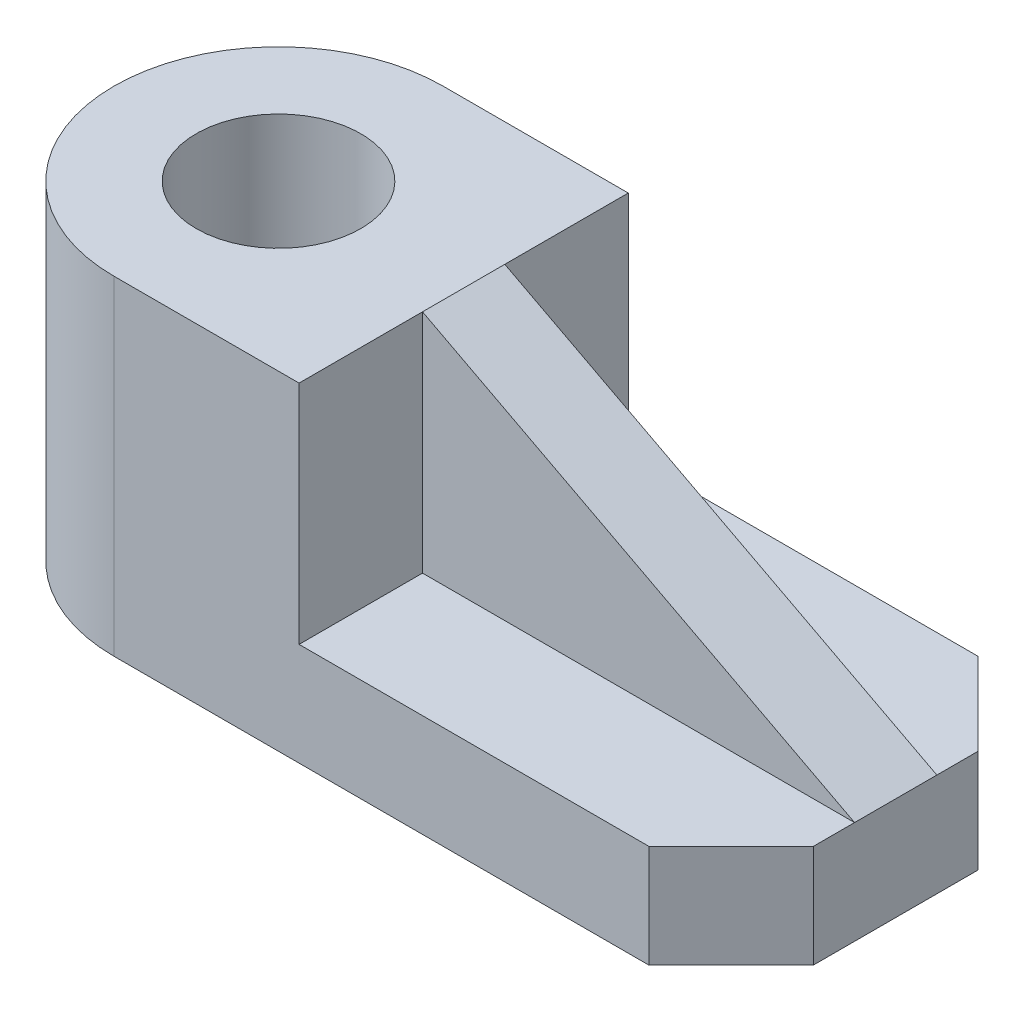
from build123d import *

# Parameters (mm, degrees)
BOSS_EXTRUDE1_DEPTH = 10
BOSS_EXTRUDE2_DEPTH = 22
SKETCH3_R           = 8
CUT_EXTRUDE1_DEPTH  = 70.856996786
RIB1_REACH          = 71.857
SKETCH4_WALL_W      = 189.127071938
SKETCH4_WALL_H      = 8
CHAMFER1_SIZE       = 8


with BuildPart() as part:
    # Sketch1 → Boss-Extrude1 (new body)
    with BuildSketch(Plane(origin=(0, 0, 0), x_dir=(1, 0, 0), z_dir=(0, 1, 0))):
        with BuildLine():
            Line((0, 16), (60, 16))
            Line((60, 16), (60, -16))
            Line((60, -16), (0, -16))
            ThreePointArc((0, -16), (-16, 0), (0, 16))
        make_face()
    extrude(amount=BOSS_EXTRUDE1_DEPTH)

    # Sketch2 → Boss-Extrude2 (add)
    with BuildSketch(Plane(origin=(0, 10, 0), x_dir=(1, 0, 0), z_dir=(0, 1, 0))):
        with BuildLine():
            Line((0, 16), (18, 16))
            Line((18, 16), (18, -16))
            Line((18, -16), (0, -16))
            ThreePointArc((0, -16), (-16, 0), (0, 16))
        make_face()
    extrude(amount=BOSS_EXTRUDE2_DEPTH)

    # Sketch3 → Cut-Extrude1 (cut, through all)
    with BuildSketch(Plane(origin=(0, 32, 0), x_dir=(1, 0, 0), z_dir=(0, 1, 0))):
        with Locations(Location((0, 0, 0), (0, 0, 270))):
            Circle(SKETCH3_R)
    extrude(amount=-CUT_EXTRUDE1_DEPTH, mode=Mode.SUBTRACT)

    # Sketch4 wall → Rib1 (add, up to next)
    with BuildSketch(Plane(origin=(39, 21, 0), x_dir=(0.88583153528, -0.464006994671, 0), z_dir=(0.464006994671, 0.88583153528, 0)), mode=Mode.PRIVATE) as rib1_sk1:
        Rectangle(SKETCH4_WALL_W, SKETCH4_WALL_H)
    rib1_tool1 = extrude(rib1_sk1.sketch, amount=-RIB1_REACH, mode=Mode.PRIVATE) - part.part
    add(rib1_tool1.solids().sort_by_distance((39, 21, 0))[0])

    # Chamfer1
    chamfer1_edges = [part.edges().sort_by_distance(p)[0] for p in [
        (60, 5, -16),
        (60, 5, 16),
    ]]
    chamfer(chamfer1_edges, length=CHAMFER1_SIZE)


solid = part.part
